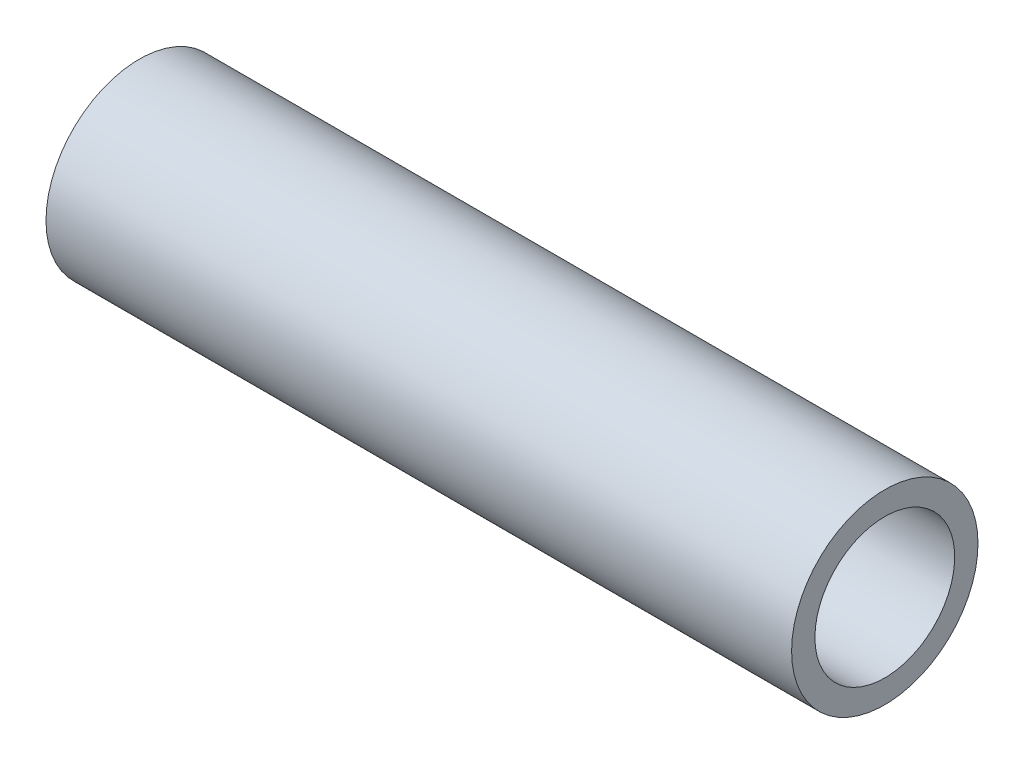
from build123d import *

# Parameters (mm, degrees)
SKETCH1_R           = 3.175
BOSS_EXTRUDE1_DEPTH = 25.4
SKETCH3_R           = 2.38125
CUT_EXTRUDE1_DEPTH  = 26.793821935


with BuildPart() as part:
    # Sketch1 → Boss-Extrude1 (new body)
    with BuildSketch(Plane(origin=(0, 0, 0), x_dir=(0, 0, -1), z_dir=(1, 0, 0))):
        Circle(SKETCH1_R)
    extrude(amount=BOSS_EXTRUDE1_DEPTH)

    # Sketch3 → Cut-Extrude1 (cut, through all)
    with BuildSketch(Plane.ZY):
        Circle(SKETCH3_R)
    extrude(amount=-CUT_EXTRUDE1_DEPTH, mode=Mode.SUBTRACT)


solid = part.part
